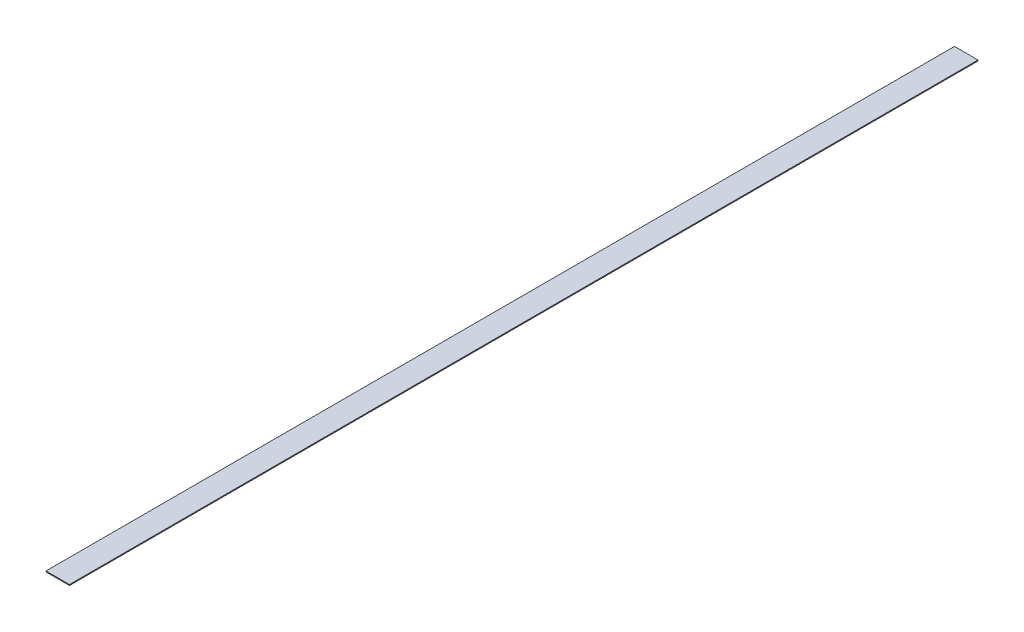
from build123d import *

# Parameters (mm, degrees)
SKETCH1_W           = 38
SKETCH1_H           = 1470
BOSS_EXTRUDE1_DEPTH = 1.5


with BuildPart() as part:
    # Sketch1 → Boss-Extrude1 (new body)
    with BuildSketch(Plane(origin=(0, 0, 0), x_dir=(1, 0, 0), z_dir=(0, 1, 0))):
        with Locations((19, 735)):
            Rectangle(SKETCH1_W, SKETCH1_H)
    extrude(amount=BOSS_EXTRUDE1_DEPTH)


solid = part.part
